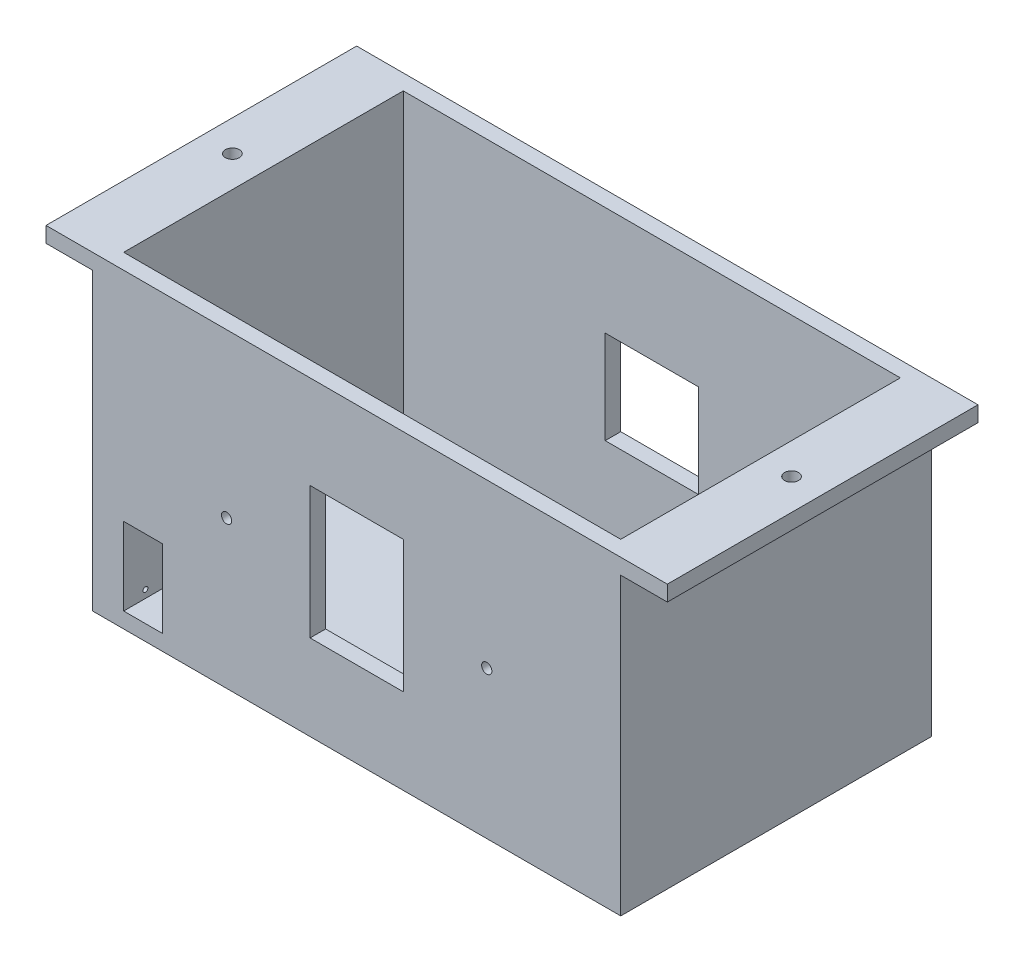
ISO-10303-21;
HEADER;
FILE_DESCRIPTION(('STEP AP214'),'2;1');
FILE_NAME('part.step','',(''),(''),'','','');
FILE_SCHEMA(('AUTOMOTIVE_DESIGN { 1 0 10303 214 1 1 1 1 }'));
ENDSEC;
DATA;
#1=APPLICATION_CONTEXT('core data for automotive mechanical design processes');
#2=APPLICATION_PROTOCOL_DEFINITION('international standard','automotive_design',2000,#1);
#3=PRODUCT_CONTEXT('',#1,'mechanical');
#4=PRODUCT('Part','Part','',(#3));
#5=PRODUCT_RELATED_PRODUCT_CATEGORY('part','',(#4));
#6=PRODUCT_DEFINITION_FORMATION('','',#4);
#7=PRODUCT_DEFINITION_CONTEXT('part definition',#1,'design');
#8=PRODUCT_DEFINITION('design','',#6,#7);
#9=PRODUCT_DEFINITION_SHAPE('','',#8);
#10=(LENGTH_UNIT() NAMED_UNIT(*) SI_UNIT(.MILLI.,.METRE.));
#11=(NAMED_UNIT(*) PLANE_ANGLE_UNIT() SI_UNIT($,.RADIAN.));
#12=(NAMED_UNIT(*) SI_UNIT($,.STERADIAN.) SOLID_ANGLE_UNIT());
#13=UNCERTAINTY_MEASURE_WITH_UNIT(LENGTH_MEASURE(1.E-05),#10,'distance_accuracy_value','');
#14=(GEOMETRIC_REPRESENTATION_CONTEXT(3) GLOBAL_UNCERTAINTY_ASSIGNED_CONTEXT((#13)) GLOBAL_UNIT_ASSIGNED_CONTEXT((#10,
#11,#12)) REPRESENTATION_CONTEXT('',''));
#15=CARTESIAN_POINT('',(0.,0.,0.));
#16=DIRECTION('',(0.,0.,1.));
#17=DIRECTION('',(1.,0.,0.));
#18=AXIS2_PLACEMENT_3D('',#15,#16,#17);
#19=CARTESIAN_POINT('',(-48.4829600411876,5.,-31.65285185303));
#20=DIRECTION('',(-1.,0.,0.));
#21=DIRECTION('',(0.,0.,1.));
#22=AXIS2_PLACEMENT_3D('',#19,#20,#21);
#23=PLANE('',#22);
#24=DIRECTION('',(0.,1.,0.));
#25=VECTOR('',#24,1.);
#26=CARTESIAN_POINT('',(-48.4829600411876,5.,13.34714814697));
#27=LINE('',#26,#25);
#28=CARTESIAN_POINT('',(-48.4829600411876,5.,13.34714814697));
#29=VERTEX_POINT('',#28);
#30=CARTESIAN_POINT('',(-48.4829600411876,30.,13.34714814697));
#31=VERTEX_POINT('',#30);
#32=EDGE_CURVE('E286',#29,#31,#27,.T.);
#33=ORIENTED_EDGE('',*,*,#32,.F.);
#34=DIRECTION('',(0.,0.,1.));
#35=VECTOR('',#34,1.);
#36=CARTESIAN_POINT('',(-48.4829600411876,5.,-31.65285185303));
#37=LINE('',#36,#35);
#38=CARTESIAN_POINT('',(-48.4829600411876,5.,-31.65285185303));
#39=VERTEX_POINT('',#38);
#40=EDGE_CURVE('E390',#39,#29,#37,.T.);
#41=ORIENTED_EDGE('',*,*,#40,.F.);
#42=DIRECTION('',(0.,1.,0.));
#43=VECTOR('',#42,1.);
#44=CARTESIAN_POINT('',(-48.4829600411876,5.,-31.65285185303));
#45=LINE('',#44,#43);
#46=CARTESIAN_POINT('',(-48.4829600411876,100.,-31.65285185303));
#47=VERTEX_POINT('',#46);
#48=EDGE_CURVE('E413',#39,#47,#45,.T.);
#49=ORIENTED_EDGE('',*,*,#48,.T.);
#50=DIRECTION('',(0.,0.,1.));
#51=VECTOR('',#50,1.);
#52=CARTESIAN_POINT('',(-48.4829600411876,100.,-31.65285185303));
#53=LINE('',#52,#51);
#54=CARTESIAN_POINT('',(-48.4829600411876,100.,58.34714814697));
#55=VERTEX_POINT('',#54);
#56=EDGE_CURVE('E372',#47,#55,#53,.T.);
#57=ORIENTED_EDGE('',*,*,#56,.T.);
#58=DIRECTION('',(0.,1.,0.));
#59=VECTOR('',#58,1.);
#60=CARTESIAN_POINT('',(-48.4829600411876,5.,58.34714814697));
#61=LINE('',#60,#59);
#62=CARTESIAN_POINT('',(-48.4829600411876,30.,58.34714814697));
#63=VERTEX_POINT('',#62);
#64=EDGE_CURVE('E402',#63,#55,#61,.T.);
#65=ORIENTED_EDGE('',*,*,#64,.F.);
#66=DIRECTION('',(0.,0.,1.));
#67=VECTOR('',#66,1.);
#68=CARTESIAN_POINT('',(-48.4829600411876,30.,13.34714814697));
#69=LINE('',#68,#67);
#70=EDGE_CURVE('E294',#31,#63,#69,.T.);
#71=ORIENTED_EDGE('',*,*,#70,.F.);
#72=EDGE_LOOP('',(#33,#41,#49,#57,#65,#71));
#73=FACE_BOUND('',#72,.T.);
#74=ADVANCED_FACE('F43',(#73),#23,.F.);
#75=CARTESIAN_POINT('',(-48.4829600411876,5.,58.34714814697));
#76=DIRECTION('',(0.,0.,1.));
#77=DIRECTION('',(1.,0.,0.));
#78=AXIS2_PLACEMENT_3D('',#75,#76,#77);
#79=PLANE('',#78);
#80=CARTESIAN_POINT('',(73.3920399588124,47.5,58.34714814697));
#81=DIRECTION('',(0.,0.,1.));
#82=DIRECTION('',(1.,0.,0.));
#83=AXIS2_PLACEMENT_3D('',#80,#81,#82);
#84=CIRCLE('',#83,1.65);
#85=CARTESIAN_POINT('',(75.0420399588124,47.5,58.34714814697));
#86=VERTEX_POINT('',#85);
#87=EDGE_CURVE('E342',#86,#86,#84,.T.);
#88=ORIENTED_EDGE('',*,*,#87,.T.);
#89=EDGE_LOOP('',(#88));
#90=FACE_BOUND('',#89,.T.);
#91=CARTESIAN_POINT('',(-10.3579600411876,47.5,58.34714814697));
#92=DIRECTION('',(0.,0.,1.));
#93=DIRECTION('',(1.,0.,0.));
#94=AXIS2_PLACEMENT_3D('',#91,#92,#93);
#95=CIRCLE('',#94,1.65);
#96=CARTESIAN_POINT('',(-8.70796004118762,47.5,58.34714814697));
#97=VERTEX_POINT('',#96);
#98=EDGE_CURVE('E336',#97,#97,#95,.T.);
#99=ORIENTED_EDGE('',*,*,#98,.T.);
#100=EDGE_LOOP('',(#99));
#101=FACE_BOUND('',#100,.T.);
#102=DIRECTION('',(-1.,0.,0.));
#103=VECTOR('',#102,1.);
#104=CARTESIAN_POINT('',(-48.4829600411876,70.,58.34714814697));
#105=LINE('',#104,#103);
#106=CARTESIAN_POINT('',(46.5170399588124,70.,58.34714814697));
#107=VERTEX_POINT('',#106);
#108=CARTESIAN_POINT('',(16.5170399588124,70.,58.34714814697));
#109=VERTEX_POINT('',#108);
#110=EDGE_CURVE('E457',#107,#109,#105,.T.);
#111=ORIENTED_EDGE('',*,*,#110,.T.);
#112=DIRECTION('',(0.,-1.,0.));
#113=VECTOR('',#112,1.);
#114=CARTESIAN_POINT('',(16.5170399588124,5.00000000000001,58.34714814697));
#115=LINE('',#114,#113);
#116=CARTESIAN_POINT('',(16.5170399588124,27.5,58.34714814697));
#117=VERTEX_POINT('',#116);
#118=EDGE_CURVE('E455',#109,#117,#115,.T.);
#119=ORIENTED_EDGE('',*,*,#118,.T.);
#120=DIRECTION('',(1.,0.,0.));
#121=VECTOR('',#120,1.);
#122=CARTESIAN_POINT('',(-48.4829600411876,27.5,58.34714814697));
#123=LINE('',#122,#121);
#124=CARTESIAN_POINT('',(46.5170399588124,27.5,58.34714814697));
#125=VERTEX_POINT('',#124);
#126=EDGE_CURVE('E448',#117,#125,#123,.T.);
#127=ORIENTED_EDGE('',*,*,#126,.T.);
#128=DIRECTION('',(0.,1.,0.));
#129=VECTOR('',#128,1.);
#130=CARTESIAN_POINT('',(46.5170399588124,5.00000000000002,58.34714814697));
#131=LINE('',#130,#129);
#132=EDGE_CURVE('E453',#125,#107,#131,.T.);
#133=ORIENTED_EDGE('',*,*,#132,.T.);
#134=EDGE_LOOP('',(#111,#119,#127,#133));
#135=FACE_BOUND('',#134,.T.);
#136=DIRECTION('',(0.,1.,0.));
#137=VECTOR('',#136,1.);
#138=CARTESIAN_POINT('',(-30.9829600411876,30.,58.34714814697));
#139=LINE('',#138,#137);
#140=CARTESIAN_POINT('',(-30.9829600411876,5.,58.34714814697));
#141=VERTEX_POINT('',#140);
#142=CARTESIAN_POINT('',(-30.9829600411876,30.,58.34714814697));
#143=VERTEX_POINT('',#142);
#144=EDGE_CURVE('E266',#141,#143,#139,.T.);
#145=ORIENTED_EDGE('',*,*,#144,.T.);
#146=DIRECTION('',(-1.,0.,0.));
#147=VECTOR('',#146,1.);
#148=CARTESIAN_POINT('',(-43.4829600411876,30.,58.34714814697));
#149=LINE('',#148,#147);
#150=CARTESIAN_POINT('',(-43.4829600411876,30.,58.34714814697));
#151=VERTEX_POINT('',#150);
#152=EDGE_CURVE('E269',#143,#151,#149,.T.);
#153=ORIENTED_EDGE('',*,*,#152,.T.);
#154=DIRECTION('',(-1.,0.,0.));
#155=VECTOR('',#154,1.);
#156=CARTESIAN_POINT('',(-43.4829600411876,30.,58.34714814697));
#157=LINE('',#156,#155);
#158=EDGE_CURVE('E307',#151,#63,#157,.T.);
#159=ORIENTED_EDGE('',*,*,#158,.T.);
#160=ORIENTED_EDGE('',*,*,#64,.T.);
#161=DIRECTION('',(1.,0.,0.));
#162=VECTOR('',#161,1.);
#163=CARTESIAN_POINT('',(-48.4829600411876,100.,58.34714814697));
#164=LINE('',#163,#162);
#165=CARTESIAN_POINT('',(111.517039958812,100.,58.34714814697));
#166=VERTEX_POINT('',#165);
#167=EDGE_CURVE('E405',#55,#166,#164,.T.);
#168=ORIENTED_EDGE('',*,*,#167,.T.);
#169=DIRECTION('',(0.,1.,0.));
#170=VECTOR('',#169,1.);
#171=CARTESIAN_POINT('',(111.517039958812,5.,58.34714814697));
#172=LINE('',#171,#170);
#173=CARTESIAN_POINT('',(111.517039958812,5.,58.34714814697));
#174=VERTEX_POINT('',#173);
#175=EDGE_CURVE('E418',#174,#166,#172,.T.);
#176=ORIENTED_EDGE('',*,*,#175,.F.);
#177=DIRECTION('',(1.,0.,0.));
#178=VECTOR('',#177,1.);
#179=CARTESIAN_POINT('',(-48.4829600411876,5.,58.34714814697));
#180=LINE('',#179,#178);
#181=EDGE_CURVE('E393',#141,#174,#180,.T.);
#182=ORIENTED_EDGE('',*,*,#181,.F.);
#183=EDGE_LOOP('',(#145,#153,#159,#160,#168,#176,#182));
#184=FACE_BOUND('',#183,.T.);
#185=ADVANCED_FACE('F483',(#90,#101,#135,#184),#79,.F.);
#186=CARTESIAN_POINT('',(0.,5.,0.));
#187=DIRECTION('',(0.,1.,0.));
#188=DIRECTION('',(0.,0.,1.));
#189=AXIS2_PLACEMENT_3D('',#186,#187,#188);
#190=PLANE('',#189);
#191=ORIENTED_EDGE('',*,*,#40,.T.);
#192=DIRECTION('',(-1.,0.,0.));
#193=VECTOR('',#192,1.);
#194=CARTESIAN_POINT('',(-43.4829600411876,5.,13.34714814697));
#195=LINE('',#194,#193);
#196=CARTESIAN_POINT('',(-43.4829600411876,5.,13.34714814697));
#197=VERTEX_POINT('',#196);
#198=EDGE_CURVE('E300',#197,#29,#195,.T.);
#199=ORIENTED_EDGE('',*,*,#198,.F.);
#200=DIRECTION('',(0.,0.,-1.));
#201=VECTOR('',#200,1.);
#202=CARTESIAN_POINT('',(-43.4829600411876,5.,13.34714814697));
#203=LINE('',#202,#201);
#204=CARTESIAN_POINT('',(-43.4829600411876,5.,63.34714814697));
#205=VERTEX_POINT('',#204);
#206=EDGE_CURVE('E297',#205,#197,#203,.T.);
#207=ORIENTED_EDGE('',*,*,#206,.F.);
#208=DIRECTION('',(1.,0.,0.));
#209=VECTOR('',#208,1.);
#210=CARTESIAN_POINT('',(-43.4829600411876,5.,63.34714814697));
#211=LINE('',#210,#209);
#212=CARTESIAN_POINT('',(-30.9829600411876,5.,63.34714814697));
#213=VERTEX_POINT('',#212);
#214=EDGE_CURVE('E276',#205,#213,#211,.T.);
#215=ORIENTED_EDGE('',*,*,#214,.T.);
#216=DIRECTION('',(0.,0.,1.));
#217=VECTOR('',#216,1.);
#218=CARTESIAN_POINT('',(-30.9829600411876,5.,58.34714814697));
#219=LINE('',#218,#217);
#220=EDGE_CURVE('E273',#141,#213,#219,.T.);
#221=ORIENTED_EDGE('',*,*,#220,.F.);
#222=ORIENTED_EDGE('',*,*,#181,.T.);
#223=DIRECTION('',(0.,0.,-1.));
#224=VECTOR('',#223,1.);
#225=CARTESIAN_POINT('',(111.517039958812,5.,-31.65285185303));
#226=LINE('',#225,#224);
#227=CARTESIAN_POINT('',(111.517039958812,5.,-31.65285185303));
#228=VERTEX_POINT('',#227);
#229=EDGE_CURVE('E396',#174,#228,#226,.T.);
#230=ORIENTED_EDGE('',*,*,#229,.T.);
#231=DIRECTION('',(-1.,0.,0.));
#232=VECTOR('',#231,1.);
#233=CARTESIAN_POINT('',(-48.4829600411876,5.,-31.65285185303));
#234=LINE('',#233,#232);
#235=EDGE_CURVE('E399',#228,#39,#234,.T.);
#236=ORIENTED_EDGE('',*,*,#235,.T.);
#237=EDGE_LOOP('',(#191,#199,#207,#215,#221,#222,#230,#236));
#238=FACE_BOUND('',#237,.T.);
#239=ADVANCED_FACE('F489',(#238),#190,.T.);
#240=CARTESIAN_POINT('',(-68.4829600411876,100.,-36.65285185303));
#241=DIRECTION('',(1.,0.,0.));
#242=DIRECTION('',(0.,0.,-1.));
#243=AXIS2_PLACEMENT_3D('',#240,#241,#242);
#244=PLANE('',#243);
#245=DIRECTION('',(0.,0.,-1.));
#246=VECTOR('',#245,1.);
#247=CARTESIAN_POINT('',(-68.4829600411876,95.,63.34714814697));
#248=LINE('',#247,#246);
#249=CARTESIAN_POINT('',(-68.4829600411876,95.,63.34714814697));
#250=VERTEX_POINT('',#249);
#251=CARTESIAN_POINT('',(-68.4829600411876,95.,-36.65285185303));
#252=VERTEX_POINT('',#251);
#253=EDGE_CURVE('E355',#250,#252,#248,.T.);
#254=ORIENTED_EDGE('',*,*,#253,.F.);
#255=DIRECTION('',(0.,-1.,0.));
#256=VECTOR('',#255,1.);
#257=CARTESIAN_POINT('',(-68.4829600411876,100.,63.34714814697));
#258=LINE('',#257,#256);
#259=CARTESIAN_POINT('',(-68.4829600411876,100.,63.34714814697));
#260=VERTEX_POINT('',#259);
#261=EDGE_CURVE('E432',#260,#250,#258,.T.);
#262=ORIENTED_EDGE('',*,*,#261,.F.);
#263=DIRECTION('',(0.,0.,1.));
#264=VECTOR('',#263,1.);
#265=CARTESIAN_POINT('',(-68.4829600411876,100.,-36.65285185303));
#266=LINE('',#265,#264);
#267=CARTESIAN_POINT('',(-68.4829600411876,100.,-36.65285185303));
#268=VERTEX_POINT('',#267);
#269=EDGE_CURVE('E430',#268,#260,#266,.T.);
#270=ORIENTED_EDGE('',*,*,#269,.F.);
#271=DIRECTION('',(0.,-1.,0.));
#272=VECTOR('',#271,1.);
#273=CARTESIAN_POINT('',(-68.4829600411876,100.,-36.65285185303));
#274=LINE('',#273,#272);
#275=EDGE_CURVE('E439',#268,#252,#274,.T.);
#276=ORIENTED_EDGE('',*,*,#275,.T.);
#277=EDGE_LOOP('',(#254,#262,#270,#276));
#278=FACE_BOUND('',#277,.T.);
#279=ADVANCED_FACE('F502',(#278),#244,.F.);
#280=CARTESIAN_POINT('',(-68.4829600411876,100.,63.34714814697));
#281=DIRECTION('',(0.,0.,-1.));
#282=DIRECTION('',(-1.,0.,0.));
#283=AXIS2_PLACEMENT_3D('',#280,#281,#282);
#284=PLANE('',#283);
#285=ORIENTED_EDGE('',*,*,#214,.F.);
#286=DIRECTION('',(0.,-1.,0.));
#287=VECTOR('',#286,1.);
#288=CARTESIAN_POINT('',(-43.4829600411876,30.,63.34714814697));
#289=LINE('',#288,#287);
#290=CARTESIAN_POINT('',(-43.4829600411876,30.,63.34714814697));
#291=VERTEX_POINT('',#290);
#292=EDGE_CURVE('E265',#291,#205,#289,.T.);
#293=ORIENTED_EDGE('',*,*,#292,.F.);
#294=DIRECTION('',(-1.,0.,0.));
#295=VECTOR('',#294,1.);
#296=CARTESIAN_POINT('',(-43.4829600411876,30.,63.34714814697));
#297=LINE('',#296,#295);
#298=CARTESIAN_POINT('',(-30.9829600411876,30.,63.34714814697));
#299=VERTEX_POINT('',#298);
#300=EDGE_CURVE('E270',#299,#291,#297,.T.);
#301=ORIENTED_EDGE('',*,*,#300,.F.);
#302=DIRECTION('',(0.,1.,0.));
#303=VECTOR('',#302,1.);
#304=CARTESIAN_POINT('',(-30.9829600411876,30.,63.34714814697));
#305=LINE('',#304,#303);
#306=EDGE_CURVE('E279',#213,#299,#305,.T.);
#307=ORIENTED_EDGE('',*,*,#306,.F.);
#308=EDGE_LOOP('',(#285,#293,#301,#307));
#309=FACE_BOUND('',#308,.T.);
#310=DIRECTION('',(0.,-1.,0.));
#311=VECTOR('',#310,1.);
#312=CARTESIAN_POINT('',(16.5170399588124,67.5,63.34714814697));
#313=LINE('',#312,#311);
#314=CARTESIAN_POINT('',(16.5170399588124,70.,63.34714814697));
#315=VERTEX_POINT('',#314);
#316=CARTESIAN_POINT('',(16.5170399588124,27.5,63.34714814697));
#317=VERTEX_POINT('',#316);
#318=EDGE_CURVE('E319',#315,#317,#313,.T.);
#319=ORIENTED_EDGE('',*,*,#318,.F.);
#320=DIRECTION('',(-1.,0.,0.));
#321=VECTOR('',#320,1.);
#322=CARTESIAN_POINT('',(16.5170399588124,70.,63.34714814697));
#323=LINE('',#322,#321);
#324=CARTESIAN_POINT('',(46.5170399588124,70.,63.34714814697));
#325=VERTEX_POINT('',#324);
#326=EDGE_CURVE('E312',#325,#315,#323,.T.);
#327=ORIENTED_EDGE('',*,*,#326,.F.);
#328=DIRECTION('',(0.,1.,0.));
#329=VECTOR('',#328,1.);
#330=CARTESIAN_POINT('',(46.5170399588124,67.5,63.34714814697));
#331=LINE('',#330,#329);
#332=CARTESIAN_POINT('',(46.5170399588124,27.5,63.34714814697));
#333=VERTEX_POINT('',#332);
#334=EDGE_CURVE('E326',#333,#325,#331,.T.);
#335=ORIENTED_EDGE('',*,*,#334,.F.);
#336=DIRECTION('',(1.,0.,0.));
#337=VECTOR('',#336,1.);
#338=CARTESIAN_POINT('',(16.5170399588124,27.5,63.34714814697));
#339=LINE('',#338,#337);
#340=EDGE_CURVE('E323',#317,#333,#339,.T.);
#341=ORIENTED_EDGE('',*,*,#340,.F.);
#342=EDGE_LOOP('',(#319,#327,#335,#341));
#343=FACE_BOUND('',#342,.T.);
#344=CARTESIAN_POINT('',(-10.3579600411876,47.5,63.34714814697));
#345=DIRECTION('',(0.,0.,1.));
#346=DIRECTION('',(1.,0.,0.));
#347=AXIS2_PLACEMENT_3D('',#344,#345,#346);
#348=CIRCLE('',#347,1.65);
#349=CARTESIAN_POINT('',(-8.70796004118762,47.5,63.34714814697));
#350=VERTEX_POINT('',#349);
#351=EDGE_CURVE('E331',#350,#350,#348,.T.);
#352=ORIENTED_EDGE('',*,*,#351,.F.);
#353=EDGE_LOOP('',(#352));
#354=FACE_BOUND('',#353,.T.);
#355=CARTESIAN_POINT('',(73.3920399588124,47.5,63.34714814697));
#356=DIRECTION('',(0.,0.,1.));
#357=DIRECTION('',(1.,0.,0.));
#358=AXIS2_PLACEMENT_3D('',#355,#356,#357);
#359=CIRCLE('',#358,1.65);
#360=CARTESIAN_POINT('',(75.0420399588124,47.5,63.34714814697));
#361=VERTEX_POINT('',#360);
#362=EDGE_CURVE('E339',#361,#361,#359,.T.);
#363=ORIENTED_EDGE('',*,*,#362,.F.);
#364=EDGE_LOOP('',(#363));
#365=FACE_BOUND('',#364,.T.);
#366=DIRECTION('',(-1.,0.,0.));
#367=VECTOR('',#366,1.);
#368=CARTESIAN_POINT('',(-68.4829600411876,95.,63.34714814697));
#369=LINE('',#368,#367);
#370=CARTESIAN_POINT('',(-53.4829600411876,95.,63.34714814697));
#371=VERTEX_POINT('',#370);
#372=EDGE_CURVE('E364',#371,#250,#369,.T.);
#373=ORIENTED_EDGE('',*,*,#372,.F.);
#374=DIRECTION('',(0.,-1.,0.));
#375=VECTOR('',#374,1.);
#376=CARTESIAN_POINT('',(-53.4829600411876,95.,63.34714814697));
#377=LINE('',#376,#375);
#378=CARTESIAN_POINT('',(-53.4829600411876,0.,63.34714814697));
#379=VERTEX_POINT('',#378);
#380=EDGE_CURVE('E369',#371,#379,#377,.T.);
#381=ORIENTED_EDGE('',*,*,#380,.T.);
#382=DIRECTION('',(1.,0.,0.));
#383=VECTOR('',#382,1.);
#384=CARTESIAN_POINT('',(-68.4829600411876,0.,63.34714814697));
#385=LINE('',#384,#383);
#386=CARTESIAN_POINT('',(116.517039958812,0.,63.34714814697));
#387=VERTEX_POINT('',#386);
#388=EDGE_CURVE('E415',#379,#387,#385,.T.);
#389=ORIENTED_EDGE('',*,*,#388,.T.);
#390=DIRECTION('',(0.,-1.,0.));
#391=VECTOR('',#390,1.);
#392=CARTESIAN_POINT('',(116.517039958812,95.,63.34714814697));
#393=LINE('',#392,#391);
#394=CARTESIAN_POINT('',(116.517039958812,95.,63.34714814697));
#395=VERTEX_POINT('',#394);
#396=EDGE_CURVE('E385',#395,#387,#393,.T.);
#397=ORIENTED_EDGE('',*,*,#396,.F.);
#398=DIRECTION('',(-1.,0.,0.));
#399=VECTOR('',#398,1.);
#400=CARTESIAN_POINT('',(131.517039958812,95.,63.34714814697));
#401=LINE('',#400,#399);
#402=CARTESIAN_POINT('',(131.517039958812,95.,63.34714814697));
#403=VERTEX_POINT('',#402);
#404=EDGE_CURVE('E376',#403,#395,#401,.T.);
#405=ORIENTED_EDGE('',*,*,#404,.F.);
#406=DIRECTION('',(0.,-1.,0.));
#407=VECTOR('',#406,1.);
#408=CARTESIAN_POINT('',(131.517039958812,100.,63.34714814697));
#409=LINE('',#408,#407);
#410=CARTESIAN_POINT('',(131.517039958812,100.,63.34714814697));
#411=VERTEX_POINT('',#410);
#412=EDGE_CURVE('E445',#411,#403,#409,.T.);
#413=ORIENTED_EDGE('',*,*,#412,.F.);
#414=DIRECTION('',(1.,0.,0.));
#415=VECTOR('',#414,1.);
#416=CARTESIAN_POINT('',(-68.4829600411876,100.,63.34714814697));
#417=LINE('',#416,#415);
#418=EDGE_CURVE('E421',#260,#411,#417,.T.);
#419=ORIENTED_EDGE('',*,*,#418,.F.);
#420=ORIENTED_EDGE('',*,*,#261,.T.);
#421=EDGE_LOOP('',(#373,#381,#389,#397,#405,#413,#419,#420));
#422=FACE_BOUND('',#421,.T.);
#423=ADVANCED_FACE('F45',(#309,#343,#354,#365,#422),#284,.F.);
#424=CARTESIAN_POINT('',(131.517039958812,100.,-36.65285185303));
#425=DIRECTION('',(1.,0.,0.));
#426=DIRECTION('',(0.,0.,-1.));
#427=AXIS2_PLACEMENT_3D('',#424,#425,#426);
#428=PLANE('',#427);
#429=DIRECTION('',(0.,0.,1.));
#430=VECTOR('',#429,1.);
#431=CARTESIAN_POINT('',(131.517039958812,95.,63.34714814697));
#432=LINE('',#431,#430);
#433=CARTESIAN_POINT('',(131.517039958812,95.,-36.65285185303));
#434=VERTEX_POINT('',#433);
#435=EDGE_CURVE('E374',#434,#403,#432,.T.);
#436=ORIENTED_EDGE('',*,*,#435,.F.);
#437=DIRECTION('',(0.,-1.,0.));
#438=VECTOR('',#437,1.);
#439=CARTESIAN_POINT('',(131.517039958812,100.,-36.65285185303));
#440=LINE('',#439,#438);
#441=CARTESIAN_POINT('',(131.517039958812,100.,-36.65285185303));
#442=VERTEX_POINT('',#441);
#443=EDGE_CURVE('E442',#442,#434,#440,.T.);
#444=ORIENTED_EDGE('',*,*,#443,.F.);
#445=DIRECTION('',(0.,0.,1.));
#446=VECTOR('',#445,1.);
#447=CARTESIAN_POINT('',(131.517039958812,100.,-36.65285185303));
#448=LINE('',#447,#446);
#449=EDGE_CURVE('E423',#442,#411,#448,.T.);
#450=ORIENTED_EDGE('',*,*,#449,.T.);
#451=ORIENTED_EDGE('',*,*,#412,.T.);
#452=EDGE_LOOP('',(#436,#444,#450,#451));
#453=FACE_BOUND('',#452,.T.);
#454=ADVANCED_FACE('F507',(#453),#428,.T.);
#455=CARTESIAN_POINT('',(-68.4829600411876,100.,-36.65285185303));
#456=DIRECTION('',(0.,0.,-1.));
#457=DIRECTION('',(-1.,0.,0.));
#458=AXIS2_PLACEMENT_3D('',#455,#456,#457);
#459=PLANE('',#458);
#460=DIRECTION('',(0.,-1.,0.));
#461=VECTOR('',#460,1.);
#462=CARTESIAN_POINT('',(46.5170399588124,65.,-36.65285185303));
#463=LINE('',#462,#461);
#464=CARTESIAN_POINT('',(46.5170399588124,65.,-36.65285185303));
#465=VERTEX_POINT('',#464);
#466=CARTESIAN_POINT('',(46.5170399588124,35.,-36.65285185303));
#467=VERTEX_POINT('',#466);
#468=EDGE_CURVE('E58',#465,#467,#463,.T.);
#469=ORIENTED_EDGE('',*,*,#468,.F.);
#470=DIRECTION('',(1.,0.,0.));
#471=VECTOR('',#470,1.);
#472=CARTESIAN_POINT('',(46.5170399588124,65.,-36.65285185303));
#473=LINE('',#472,#471);
#474=CARTESIAN_POINT('',(16.5170399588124,65.,-36.65285185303));
#475=VERTEX_POINT('',#474);
#476=EDGE_CURVE('E232',#475,#465,#473,.T.);
#477=ORIENTED_EDGE('',*,*,#476,.F.);
#478=DIRECTION('',(0.,1.,0.));
#479=VECTOR('',#478,1.);
#480=CARTESIAN_POINT('',(16.5170399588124,65.,-36.65285185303));
#481=LINE('',#480,#479);
#482=CARTESIAN_POINT('',(16.5170399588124,35.,-36.65285185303));
#483=VERTEX_POINT('',#482);
#484=EDGE_CURVE('E216',#483,#475,#481,.T.);
#485=ORIENTED_EDGE('',*,*,#484,.F.);
#486=DIRECTION('',(-1.,0.,0.));
#487=VECTOR('',#486,1.);
#488=CARTESIAN_POINT('',(46.5170399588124,35.,-36.65285185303));
#489=LINE('',#488,#487);
#490=EDGE_CURVE('E225',#467,#483,#489,.T.);
#491=ORIENTED_EDGE('',*,*,#490,.F.);
#492=EDGE_LOOP('',(#469,#477,#485,#491));
#493=FACE_BOUND('',#492,.T.);
#494=DIRECTION('',(0.,-1.,0.));
#495=VECTOR('',#494,1.);
#496=CARTESIAN_POINT('',(-53.4829600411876,95.,-36.65285185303));
#497=LINE('',#496,#495);
#498=CARTESIAN_POINT('',(-53.4829600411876,95.,-36.65285185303));
#499=VERTEX_POINT('',#498);
#500=CARTESIAN_POINT('',(-53.4829600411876,0.,-36.65285185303));
#501=VERTEX_POINT('',#500);
#502=EDGE_CURVE('E366',#499,#501,#497,.T.);
#503=ORIENTED_EDGE('',*,*,#502,.F.);
#504=DIRECTION('',(1.,0.,0.));
#505=VECTOR('',#504,1.);
#506=CARTESIAN_POINT('',(-68.4829600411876,95.,-36.65285185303));
#507=LINE('',#506,#505);
#508=EDGE_CURVE('E357',#252,#499,#507,.T.);
#509=ORIENTED_EDGE('',*,*,#508,.F.);
#510=ORIENTED_EDGE('',*,*,#275,.F.);
#511=DIRECTION('',(1.,0.,0.));
#512=VECTOR('',#511,1.);
#513=CARTESIAN_POINT('',(-68.4829600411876,100.,-36.65285185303));
#514=LINE('',#513,#512);
#515=EDGE_CURVE('E427',#268,#442,#514,.T.);
#516=ORIENTED_EDGE('',*,*,#515,.T.);
#517=ORIENTED_EDGE('',*,*,#443,.T.);
#518=DIRECTION('',(1.,0.,0.));
#519=VECTOR('',#518,1.);
#520=CARTESIAN_POINT('',(131.517039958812,95.,-36.65285185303));
#521=LINE('',#520,#519);
#522=CARTESIAN_POINT('',(116.517039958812,95.,-36.65285185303));
#523=VERTEX_POINT('',#522);
#524=EDGE_CURVE('E383',#523,#434,#521,.T.);
#525=ORIENTED_EDGE('',*,*,#524,.F.);
#526=DIRECTION('',(0.,-1.,0.));
#527=VECTOR('',#526,1.);
#528=CARTESIAN_POINT('',(116.517039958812,95.,-36.65285185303));
#529=LINE('',#528,#527);
#530=CARTESIAN_POINT('',(116.517039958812,0.,-36.65285185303));
#531=VERTEX_POINT('',#530);
#532=EDGE_CURVE('E368',#523,#531,#529,.T.);
#533=ORIENTED_EDGE('',*,*,#532,.T.);
#534=DIRECTION('',(1.,0.,0.));
#535=VECTOR('',#534,1.);
#536=CARTESIAN_POINT('',(-68.4829600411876,0.,-36.65285185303));
#537=LINE('',#536,#535);
#538=EDGE_CURVE('E424',#501,#531,#537,.T.);
#539=ORIENTED_EDGE('',*,*,#538,.F.);
#540=EDGE_LOOP('',(#503,#509,#510,#516,#517,#525,#533,#539));
#541=FACE_BOUND('',#540,.T.);
#542=ADVANCED_FACE('F229',(#493,#541),#459,.T.);
#543=CARTESIAN_POINT('',(0.,100.,0.));
#544=DIRECTION('',(0.,-1.,0.));
#545=DIRECTION('',(0.,0.,-1.));
#546=AXIS2_PLACEMENT_3D('',#543,#544,#545);
#547=PLANE('',#546);
#548=CARTESIAN_POINT('',(-58.4829600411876,100.,13.34714814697));
#549=DIRECTION('',(0.,1.,0.));
#550=DIRECTION('',(0.,0.,1.));
#551=AXIS2_PLACEMENT_3D('',#548,#549,#550);
#552=CIRCLE('',#551,2.24789999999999);
#553=CARTESIAN_POINT('',(-58.4829600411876,100.,15.59504814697));
#554=VERTEX_POINT('',#553);
#555=EDGE_CURVE('E345',#554,#554,#552,.T.);
#556=ORIENTED_EDGE('',*,*,#555,.F.);
#557=EDGE_LOOP('',(#556));
#558=FACE_BOUND('',#557,.T.);
#559=CARTESIAN_POINT('',(121.517039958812,100.,13.34714814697));
#560=DIRECTION('',(0.,1.,0.));
#561=DIRECTION('',(0.,0.,1.));
#562=AXIS2_PLACEMENT_3D('',#559,#560,#561);
#563=CIRCLE('',#562,2.24789999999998);
#564=CARTESIAN_POINT('',(121.517039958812,100.,15.59504814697));
#565=VERTEX_POINT('',#564);
#566=EDGE_CURVE('E351',#565,#565,#563,.T.);
#567=ORIENTED_EDGE('',*,*,#566,.F.);
#568=EDGE_LOOP('',(#567));
#569=FACE_BOUND('',#568,.T.);
#570=ORIENTED_EDGE('',*,*,#167,.F.);
#571=ORIENTED_EDGE('',*,*,#56,.F.);
#572=DIRECTION('',(-1.,0.,0.));
#573=VECTOR('',#572,1.);
#574=CARTESIAN_POINT('',(-48.4829600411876,100.,-31.65285185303));
#575=LINE('',#574,#573);
#576=CARTESIAN_POINT('',(111.517039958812,100.,-31.65285185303));
#577=VERTEX_POINT('',#576);
#578=EDGE_CURVE('E394',#577,#47,#575,.T.);
#579=ORIENTED_EDGE('',*,*,#578,.F.);
#580=DIRECTION('',(0.,0.,-1.));
#581=VECTOR('',#580,1.);
#582=CARTESIAN_POINT('',(111.517039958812,100.,-31.65285185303));
#583=LINE('',#582,#581);
#584=EDGE_CURVE('E408',#166,#577,#583,.T.);
#585=ORIENTED_EDGE('',*,*,#584,.F.);
#586=EDGE_LOOP('',(#570,#571,#579,#585));
#587=FACE_BOUND('',#586,.T.);
#588=ORIENTED_EDGE('',*,*,#418,.T.);
#589=ORIENTED_EDGE('',*,*,#449,.F.);
#590=ORIENTED_EDGE('',*,*,#515,.F.);
#591=ORIENTED_EDGE('',*,*,#269,.T.);
#592=EDGE_LOOP('',(#588,#589,#590,#591));
#593=FACE_BOUND('',#592,.T.);
#594=ADVANCED_FACE('F494',(#558,#569,#587,#593),#547,.F.);
#595=CARTESIAN_POINT('',(0.,0.,0.));
#596=DIRECTION('',(0.,-1.,0.));
#597=DIRECTION('',(0.,0.,-1.));
#598=AXIS2_PLACEMENT_3D('',#595,#596,#597);
#599=PLANE('',#598);
#600=DIRECTION('',(0.,0.,1.));
#601=VECTOR('',#600,1.);
#602=CARTESIAN_POINT('',(-53.4829600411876,0.,63.34714814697));
#603=LINE('',#602,#601);
#604=EDGE_CURVE('E358',#501,#379,#603,.T.);
#605=ORIENTED_EDGE('',*,*,#604,.F.);
#606=ORIENTED_EDGE('',*,*,#538,.T.);
#607=DIRECTION('',(0.,0.,-1.));
#608=VECTOR('',#607,1.);
#609=CARTESIAN_POINT('',(116.517039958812,0.,63.34714814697));
#610=LINE('',#609,#608);
#611=EDGE_CURVE('E377',#387,#531,#610,.T.);
#612=ORIENTED_EDGE('',*,*,#611,.F.);
#613=ORIENTED_EDGE('',*,*,#388,.F.);
#614=EDGE_LOOP('',(#605,#606,#612,#613));
#615=FACE_BOUND('',#614,.T.);
#616=ADVANCED_FACE('F497',(#615),#599,.T.);
#617=CARTESIAN_POINT('',(-48.4829600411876,5.,-31.65285185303));
#618=DIRECTION('',(0.,0.,-1.));
#619=DIRECTION('',(-1.,0.,0.));
#620=AXIS2_PLACEMENT_3D('',#617,#618,#619);
#621=PLANE('',#620);
#622=DIRECTION('',(1.,0.,0.));
#623=VECTOR('',#622,1.);
#624=CARTESIAN_POINT('',(-48.4829600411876,65.,-31.65285185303));
#625=LINE('',#624,#623);
#626=CARTESIAN_POINT('',(16.5170399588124,65.,-31.65285185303));
#627=VERTEX_POINT('',#626);
#628=CARTESIAN_POINT('',(46.5170399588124,65.,-31.65285185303));
#629=VERTEX_POINT('',#628);
#630=EDGE_CURVE('E51',#627,#629,#625,.T.);
#631=ORIENTED_EDGE('',*,*,#630,.T.);
#632=DIRECTION('',(0.,-1.,0.));
#633=VECTOR('',#632,1.);
#634=CARTESIAN_POINT('',(46.5170399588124,4.99999999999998,-31.65285185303));
#635=LINE('',#634,#633);
#636=CARTESIAN_POINT('',(46.5170399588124,35.,-31.65285185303));
#637=VERTEX_POINT('',#636);
#638=EDGE_CURVE('E11',#629,#637,#635,.T.);
#639=ORIENTED_EDGE('',*,*,#638,.T.);
#640=DIRECTION('',(-1.,0.,0.));
#641=VECTOR('',#640,1.);
#642=CARTESIAN_POINT('',(-48.4829600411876,35.,-31.65285185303));
#643=LINE('',#642,#641);
#644=CARTESIAN_POINT('',(16.5170399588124,35.,-31.65285185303));
#645=VERTEX_POINT('',#644);
#646=EDGE_CURVE('E460',#637,#645,#643,.T.);
#647=ORIENTED_EDGE('',*,*,#646,.T.);
#648=DIRECTION('',(0.,1.,0.));
#649=VECTOR('',#648,1.);
#650=CARTESIAN_POINT('',(16.5170399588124,5.,-31.65285185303));
#651=LINE('',#650,#649);
#652=EDGE_CURVE('E219',#645,#627,#651,.T.);
#653=ORIENTED_EDGE('',*,*,#652,.T.);
#654=EDGE_LOOP('',(#631,#639,#647,#653));
#655=FACE_BOUND('',#654,.T.);
#656=ORIENTED_EDGE('',*,*,#578,.T.);
#657=ORIENTED_EDGE('',*,*,#48,.F.);
#658=ORIENTED_EDGE('',*,*,#235,.F.);
#659=DIRECTION('',(0.,1.,0.));
#660=VECTOR('',#659,1.);
#661=CARTESIAN_POINT('',(111.517039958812,5.,-31.65285185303));
#662=LINE('',#661,#660);
#663=EDGE_CURVE('E416',#228,#577,#662,.T.);
#664=ORIENTED_EDGE('',*,*,#663,.T.);
#665=EDGE_LOOP('',(#656,#657,#658,#664));
#666=FACE_BOUND('',#665,.T.);
#667=ADVANCED_FACE('F464',(#655,#666),#621,.F.);
#668=CARTESIAN_POINT('',(111.517039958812,5.,-31.65285185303));
#669=DIRECTION('',(1.,0.,0.));
#670=DIRECTION('',(0.,0.,-1.));
#671=AXIS2_PLACEMENT_3D('',#668,#669,#670);
#672=PLANE('',#671);
#673=ORIENTED_EDGE('',*,*,#584,.T.);
#674=ORIENTED_EDGE('',*,*,#663,.F.);
#675=ORIENTED_EDGE('',*,*,#229,.F.);
#676=ORIENTED_EDGE('',*,*,#175,.T.);
#677=EDGE_LOOP('',(#673,#674,#675,#676));
#678=FACE_BOUND('',#677,.T.);
#679=ADVANCED_FACE('F564',(#678),#672,.F.);
#680=CARTESIAN_POINT('',(116.517039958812,95.,63.34714814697));
#681=DIRECTION('',(-1.,0.,0.));
#682=DIRECTION('',(0.,0.,1.));
#683=AXIS2_PLACEMENT_3D('',#680,#681,#682);
#684=PLANE('',#683);
#685=ORIENTED_EDGE('',*,*,#611,.T.);
#686=ORIENTED_EDGE('',*,*,#532,.F.);
#687=DIRECTION('',(0.,0.,-1.));
#688=VECTOR('',#687,1.);
#689=CARTESIAN_POINT('',(116.517039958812,95.,63.34714814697));
#690=LINE('',#689,#688);
#691=EDGE_CURVE('E380',#395,#523,#690,.T.);
#692=ORIENTED_EDGE('',*,*,#691,.F.);
#693=ORIENTED_EDGE('',*,*,#396,.T.);
#694=EDGE_LOOP('',(#685,#686,#692,#693));
#695=FACE_BOUND('',#694,.T.);
#696=ADVANCED_FACE('F533',(#695),#684,.F.);
#697=CARTESIAN_POINT('',(0.,95.,0.));
#698=DIRECTION('',(0.,1.,0.));
#699=DIRECTION('',(0.,0.,1.));
#700=AXIS2_PLACEMENT_3D('',#697,#698,#699);
#701=PLANE('',#700);
#702=CARTESIAN_POINT('',(121.517039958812,95.,13.34714814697));
#703=DIRECTION('',(0.,1.,0.));
#704=DIRECTION('',(0.,0.,1.));
#705=AXIS2_PLACEMENT_3D('',#702,#703,#704);
#706=CIRCLE('',#705,2.24789999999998);
#707=CARTESIAN_POINT('',(121.517039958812,95.,15.59504814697));
#708=VERTEX_POINT('',#707);
#709=EDGE_CURVE('E354',#708,#708,#706,.T.);
#710=ORIENTED_EDGE('',*,*,#709,.T.);
#711=EDGE_LOOP('',(#710));
#712=FACE_BOUND('',#711,.T.);
#713=ORIENTED_EDGE('',*,*,#435,.T.);
#714=ORIENTED_EDGE('',*,*,#404,.T.);
#715=ORIENTED_EDGE('',*,*,#691,.T.);
#716=ORIENTED_EDGE('',*,*,#524,.T.);
#717=EDGE_LOOP('',(#713,#714,#715,#716));
#718=FACE_BOUND('',#717,.T.);
#719=ADVANCED_FACE('F531',(#712,#718),#701,.F.);
#720=CARTESIAN_POINT('',(-53.4829600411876,95.,63.34714814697));
#721=DIRECTION('',(1.,0.,0.));
#722=DIRECTION('',(0.,0.,-1.));
#723=AXIS2_PLACEMENT_3D('',#720,#721,#722);
#724=PLANE('',#723);
#725=CARTESIAN_POINT('',(-53.4829600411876,27.,56.34714814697));
#726=DIRECTION('',(1.,0.,0.));
#727=DIRECTION('',(0.,0.,-1.));
#728=AXIS2_PLACEMENT_3D('',#725,#726,#727);
#729=CIRCLE('',#728,0.799999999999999);
#730=CARTESIAN_POINT('',(-53.4829600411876,27.,55.54714814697));
#731=VERTEX_POINT('',#730);
#732=EDGE_CURVE('E244',#731,#731,#729,.T.);
#733=ORIENTED_EDGE('',*,*,#732,.T.);
#734=EDGE_LOOP('',(#733));
#735=FACE_BOUND('',#734,.T.);
#736=CARTESIAN_POINT('',(-53.4829600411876,27.,18.34714814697));
#737=DIRECTION('',(1.,0.,0.));
#738=DIRECTION('',(0.,0.,-1.));
#739=AXIS2_PLACEMENT_3D('',#736,#737,#738);
#740=CIRCLE('',#739,0.799999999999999);
#741=CARTESIAN_POINT('',(-53.4829600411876,27.,17.54714814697));
#742=VERTEX_POINT('',#741);
#743=EDGE_CURVE('E250',#742,#742,#740,.T.);
#744=ORIENTED_EDGE('',*,*,#743,.T.);
#745=EDGE_LOOP('',(#744));
#746=FACE_BOUND('',#745,.T.);
#747=CARTESIAN_POINT('',(-53.4829600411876,7.5,18.34714814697));
#748=DIRECTION('',(1.,0.,0.));
#749=DIRECTION('',(0.,0.,-1.));
#750=AXIS2_PLACEMENT_3D('',#747,#748,#749);
#751=CIRCLE('',#750,0.799999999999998);
#752=CARTESIAN_POINT('',(-53.4829600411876,7.5,17.54714814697));
#753=VERTEX_POINT('',#752);
#754=EDGE_CURVE('E256',#753,#753,#751,.T.);
#755=ORIENTED_EDGE('',*,*,#754,.T.);
#756=EDGE_LOOP('',(#755));
#757=FACE_BOUND('',#756,.T.);
#758=CARTESIAN_POINT('',(-53.4829600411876,7.5,56.34714814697));
#759=DIRECTION('',(1.,0.,0.));
#760=DIRECTION('',(0.,0.,-1.));
#761=AXIS2_PLACEMENT_3D('',#758,#759,#760);
#762=CIRCLE('',#761,0.799999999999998);
#763=CARTESIAN_POINT('',(-53.4829600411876,7.5,55.54714814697));
#764=VERTEX_POINT('',#763);
#765=EDGE_CURVE('E262',#764,#764,#762,.T.);
#766=ORIENTED_EDGE('',*,*,#765,.T.);
#767=EDGE_LOOP('',(#766));
#768=FACE_BOUND('',#767,.T.);
#769=ORIENTED_EDGE('',*,*,#604,.T.);
#770=ORIENTED_EDGE('',*,*,#380,.F.);
#771=DIRECTION('',(0.,0.,1.));
#772=VECTOR('',#771,1.);
#773=CARTESIAN_POINT('',(-53.4829600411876,95.,63.34714814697));
#774=LINE('',#773,#772);
#775=EDGE_CURVE('E361',#499,#371,#774,.T.);
#776=ORIENTED_EDGE('',*,*,#775,.F.);
#777=ORIENTED_EDGE('',*,*,#502,.T.);
#778=EDGE_LOOP('',(#769,#770,#776,#777));
#779=FACE_BOUND('',#778,.T.);
#780=ADVANCED_FACE('F539',(#735,#746,#757,#768,#779),#724,.F.);
#781=CARTESIAN_POINT('',(0.,95.,0.));
#782=DIRECTION('',(0.,-1.,0.));
#783=DIRECTION('',(0.,0.,-1.));
#784=AXIS2_PLACEMENT_3D('',#781,#782,#783);
#785=PLANE('',#784);
#786=CARTESIAN_POINT('',(-58.4829600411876,95.,13.34714814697));
#787=DIRECTION('',(0.,-1.,0.));
#788=DIRECTION('',(0.,0.,-1.));
#789=AXIS2_PLACEMENT_3D('',#786,#787,#788);
#790=CIRCLE('',#789,2.24789999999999);
#791=CARTESIAN_POINT('',(-58.4829600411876,95.,11.09924814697));
#792=VERTEX_POINT('',#791);
#793=EDGE_CURVE('E348',#792,#792,#790,.T.);
#794=ORIENTED_EDGE('',*,*,#793,.F.);
#795=EDGE_LOOP('',(#794));
#796=FACE_BOUND('',#795,.T.);
#797=ORIENTED_EDGE('',*,*,#253,.T.);
#798=ORIENTED_EDGE('',*,*,#508,.T.);
#799=ORIENTED_EDGE('',*,*,#775,.T.);
#800=ORIENTED_EDGE('',*,*,#372,.T.);
#801=EDGE_LOOP('',(#797,#798,#799,#800));
#802=FACE_BOUND('',#801,.T.);
#803=ADVANCED_FACE('F542',(#796,#802),#785,.T.);
#804=CARTESIAN_POINT('',(121.517039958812,100.,13.34714814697));
#805=DIRECTION('',(0.,1.,0.));
#806=DIRECTION('',(0.,0.,1.));
#807=AXIS2_PLACEMENT_3D('',#804,#805,#806);
#808=CYLINDRICAL_SURFACE('',#807,2.24789999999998);
#809=ORIENTED_EDGE('',*,*,#566,.T.);
#810=EDGE_LOOP('',(#809));
#811=FACE_BOUND('',#810,.T.);
#812=ORIENTED_EDGE('',*,*,#709,.F.);
#813=EDGE_LOOP('',(#812));
#814=FACE_BOUND('',#813,.T.);
#815=ADVANCED_FACE('F544',(#811,#814),#808,.F.);
#816=CARTESIAN_POINT('',(-58.4829600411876,100.,13.34714814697));
#817=DIRECTION('',(0.,1.,0.));
#818=DIRECTION('',(0.,0.,1.));
#819=AXIS2_PLACEMENT_3D('',#816,#817,#818);
#820=CYLINDRICAL_SURFACE('',#819,2.24789999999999);
#821=ORIENTED_EDGE('',*,*,#793,.T.);
#822=EDGE_LOOP('',(#821));
#823=FACE_BOUND('',#822,.T.);
#824=ORIENTED_EDGE('',*,*,#555,.T.);
#825=EDGE_LOOP('',(#824));
#826=FACE_BOUND('',#825,.T.);
#827=ADVANCED_FACE('F551',(#823,#826),#820,.F.);
#828=CARTESIAN_POINT('',(73.3920399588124,47.5,63.34714814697));
#829=DIRECTION('',(0.,0.,1.));
#830=DIRECTION('',(1.,0.,0.));
#831=AXIS2_PLACEMENT_3D('',#828,#829,#830);
#832=CYLINDRICAL_SURFACE('',#831,1.65);
#833=ORIENTED_EDGE('',*,*,#87,.F.);
#834=EDGE_LOOP('',(#833));
#835=FACE_BOUND('',#834,.T.);
#836=ORIENTED_EDGE('',*,*,#362,.T.);
#837=EDGE_LOOP('',(#836));
#838=FACE_BOUND('',#837,.T.);
#839=ADVANCED_FACE('F636',(#835,#838),#832,.F.);
#840=CARTESIAN_POINT('',(-10.3579600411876,47.5,63.34714814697));
#841=DIRECTION('',(0.,0.,1.));
#842=DIRECTION('',(1.,0.,0.));
#843=AXIS2_PLACEMENT_3D('',#840,#841,#842);
#844=CYLINDRICAL_SURFACE('',#843,1.65);
#845=ORIENTED_EDGE('',*,*,#98,.F.);
#846=EDGE_LOOP('',(#845));
#847=FACE_BOUND('',#846,.T.);
#848=ORIENTED_EDGE('',*,*,#351,.T.);
#849=EDGE_LOOP('',(#848));
#850=FACE_BOUND('',#849,.T.);
#851=ADVANCED_FACE('F632',(#847,#850),#844,.F.);
#852=CARTESIAN_POINT('',(16.5170399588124,67.5,53.34714814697));
#853=DIRECTION('',(-1.,0.,0.));
#854=DIRECTION('',(0.,-1.,0.));
#855=AXIS2_PLACEMENT_3D('',#852,#853,#854);
#856=PLANE('',#855);
#857=DIRECTION('',(0.,0.,1.));
#858=VECTOR('',#857,1.);
#859=CARTESIAN_POINT('',(16.5170399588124,27.5,53.34714814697));
#860=LINE('',#859,#858);
#861=EDGE_CURVE('E328',#117,#317,#860,.T.);
#862=ORIENTED_EDGE('',*,*,#861,.F.);
#863=ORIENTED_EDGE('',*,*,#118,.F.);
#864=DIRECTION('',(0.,0.,1.));
#865=VECTOR('',#864,1.);
#866=CARTESIAN_POINT('',(16.5170399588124,70.,53.34714814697));
#867=LINE('',#866,#865);
#868=EDGE_CURVE('E316',#109,#315,#867,.T.);
#869=ORIENTED_EDGE('',*,*,#868,.T.);
#870=ORIENTED_EDGE('',*,*,#318,.T.);
#871=EDGE_LOOP('',(#862,#863,#869,#870));
#872=FACE_BOUND('',#871,.T.);
#873=ADVANCED_FACE('F625',(#872),#856,.F.);
#874=CARTESIAN_POINT('',(46.5170399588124,67.5,53.34714814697));
#875=DIRECTION('',(1.,0.,0.));
#876=DIRECTION('',(0.,1.,0.));
#877=AXIS2_PLACEMENT_3D('',#874,#875,#876);
#878=PLANE('',#877);
#879=ORIENTED_EDGE('',*,*,#334,.T.);
#880=DIRECTION('',(0.,0.,1.));
#881=VECTOR('',#880,1.);
#882=CARTESIAN_POINT('',(46.5170399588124,70.,53.34714814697));
#883=LINE('',#882,#881);
#884=EDGE_CURVE('E315',#107,#325,#883,.T.);
#885=ORIENTED_EDGE('',*,*,#884,.F.);
#886=ORIENTED_EDGE('',*,*,#132,.F.);
#887=DIRECTION('',(0.,0.,1.));
#888=VECTOR('',#887,1.);
#889=CARTESIAN_POINT('',(46.5170399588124,27.5,53.34714814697));
#890=LINE('',#889,#888);
#891=EDGE_CURVE('E329',#125,#333,#890,.T.);
#892=ORIENTED_EDGE('',*,*,#891,.T.);
#893=EDGE_LOOP('',(#879,#885,#886,#892));
#894=FACE_BOUND('',#893,.T.);
#895=ADVANCED_FACE('F622',(#894),#878,.F.);
#896=CARTESIAN_POINT('',(16.5170399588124,27.5,53.34714814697));
#897=DIRECTION('',(0.,-1.,0.));
#898=DIRECTION('',(0.,0.,-1.));
#899=AXIS2_PLACEMENT_3D('',#896,#897,#898);
#900=PLANE('',#899);
#901=ORIENTED_EDGE('',*,*,#861,.T.);
#902=ORIENTED_EDGE('',*,*,#340,.T.);
#903=ORIENTED_EDGE('',*,*,#891,.F.);
#904=ORIENTED_EDGE('',*,*,#126,.F.);
#905=EDGE_LOOP('',(#901,#902,#903,#904));
#906=FACE_BOUND('',#905,.T.);
#907=ADVANCED_FACE('F620',(#906),#900,.F.);
#908=CARTESIAN_POINT('',(16.5170399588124,70.,53.34714814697));
#909=DIRECTION('',(0.,1.,0.));
#910=DIRECTION('',(0.,0.,1.));
#911=AXIS2_PLACEMENT_3D('',#908,#909,#910);
#912=PLANE('',#911);
#913=ORIENTED_EDGE('',*,*,#884,.T.);
#914=ORIENTED_EDGE('',*,*,#326,.T.);
#915=ORIENTED_EDGE('',*,*,#868,.F.);
#916=ORIENTED_EDGE('',*,*,#110,.F.);
#917=EDGE_LOOP('',(#913,#914,#915,#916));
#918=FACE_BOUND('',#917,.T.);
#919=ADVANCED_FACE('F614',(#918),#912,.F.);
#920=CARTESIAN_POINT('',(-43.4829600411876,5.,13.34714814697));
#921=DIRECTION('',(0.,0.,1.));
#922=DIRECTION('',(1.,0.,0.));
#923=AXIS2_PLACEMENT_3D('',#920,#921,#922);
#924=PLANE('',#923);
#925=ORIENTED_EDGE('',*,*,#32,.T.);
#926=DIRECTION('',(-1.,0.,0.));
#927=VECTOR('',#926,1.);
#928=CARTESIAN_POINT('',(-43.4829600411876,30.,13.34714814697));
#929=LINE('',#928,#927);
#930=CARTESIAN_POINT('',(-43.4829600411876,30.,13.34714814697));
#931=VERTEX_POINT('',#930);
#932=EDGE_CURVE('E309',#931,#31,#929,.T.);
#933=ORIENTED_EDGE('',*,*,#932,.F.);
#934=DIRECTION('',(0.,1.,0.));
#935=VECTOR('',#934,1.);
#936=CARTESIAN_POINT('',(-43.4829600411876,5.,13.34714814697));
#937=LINE('',#936,#935);
#938=EDGE_CURVE('E290',#197,#931,#937,.T.);
#939=ORIENTED_EDGE('',*,*,#938,.F.);
#940=ORIENTED_EDGE('',*,*,#198,.T.);
#941=EDGE_LOOP('',(#925,#933,#939,#940));
#942=FACE_BOUND('',#941,.T.);
#943=ADVANCED_FACE('F590',(#942),#924,.F.);
#944=CARTESIAN_POINT('',(-43.4829600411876,30.,13.34714814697));
#945=DIRECTION('',(0.,-1.,0.));
#946=DIRECTION('',(0.,0.,-1.));
#947=AXIS2_PLACEMENT_3D('',#944,#945,#946);
#948=PLANE('',#947);
#949=ORIENTED_EDGE('',*,*,#70,.T.);
#950=ORIENTED_EDGE('',*,*,#158,.F.);
#951=DIRECTION('',(0.,0.,1.));
#952=VECTOR('',#951,1.);
#953=CARTESIAN_POINT('',(-43.4829600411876,30.,13.34714814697));
#954=LINE('',#953,#952);
#955=EDGE_CURVE('E293',#931,#151,#954,.T.);
#956=ORIENTED_EDGE('',*,*,#955,.F.);
#957=ORIENTED_EDGE('',*,*,#932,.T.);
#958=EDGE_LOOP('',(#949,#950,#956,#957));
#959=FACE_BOUND('',#958,.T.);
#960=ADVANCED_FACE('F604',(#959),#948,.F.);
#961=CARTESIAN_POINT('',(-43.4829600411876,0.,0.));
#962=DIRECTION('',(1.,0.,0.));
#963=DIRECTION('',(0.,0.,-1.));
#964=AXIS2_PLACEMENT_3D('',#961,#962,#963);
#965=PLANE('',#964);
#966=CARTESIAN_POINT('',(-43.4829600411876,27.,56.34714814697));
#967=DIRECTION('',(1.,0.,0.));
#968=DIRECTION('',(0.,0.,-1.));
#969=AXIS2_PLACEMENT_3D('',#966,#967,#968);
#970=CIRCLE('',#969,0.799999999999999);
#971=CARTESIAN_POINT('',(-43.4829600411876,27.,55.54714814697));
#972=VERTEX_POINT('',#971);
#973=EDGE_CURVE('E239',#972,#972,#970,.T.);
#974=ORIENTED_EDGE('',*,*,#973,.F.);
#975=EDGE_LOOP('',(#974));
#976=FACE_BOUND('',#975,.T.);
#977=CARTESIAN_POINT('',(-43.4829600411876,27.,18.34714814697));
#978=DIRECTION('',(1.,0.,0.));
#979=DIRECTION('',(0.,0.,-1.));
#980=AXIS2_PLACEMENT_3D('',#977,#978,#979);
#981=CIRCLE('',#980,0.799999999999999);
#982=CARTESIAN_POINT('',(-43.4829600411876,27.,17.54714814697));
#983=VERTEX_POINT('',#982);
#984=EDGE_CURVE('E247',#983,#983,#981,.T.);
#985=ORIENTED_EDGE('',*,*,#984,.F.);
#986=EDGE_LOOP('',(#985));
#987=FACE_BOUND('',#986,.T.);
#988=CARTESIAN_POINT('',(-43.4829600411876,7.5,18.34714814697));
#989=DIRECTION('',(1.,0.,0.));
#990=DIRECTION('',(0.,0.,-1.));
#991=AXIS2_PLACEMENT_3D('',#988,#989,#990);
#992=CIRCLE('',#991,0.799999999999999);
#993=CARTESIAN_POINT('',(-43.4829600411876,7.5,17.54714814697));
#994=VERTEX_POINT('',#993);
#995=EDGE_CURVE('E253',#994,#994,#992,.T.);
#996=ORIENTED_EDGE('',*,*,#995,.F.);
#997=EDGE_LOOP('',(#996));
#998=FACE_BOUND('',#997,.T.);
#999=CARTESIAN_POINT('',(-43.4829600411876,7.5,56.34714814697));
#1000=DIRECTION('',(1.,0.,0.));
#1001=DIRECTION('',(0.,0.,-1.));
#1002=AXIS2_PLACEMENT_3D('',#999,#1000,#1001);
#1003=CIRCLE('',#1002,0.799999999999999);
#1004=CARTESIAN_POINT('',(-43.4829600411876,7.5,55.54714814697));
#1005=VERTEX_POINT('',#1004);
#1006=EDGE_CURVE('E259',#1005,#1005,#1003,.T.);
#1007=ORIENTED_EDGE('',*,*,#1006,.F.);
#1008=EDGE_LOOP('',(#1007));
#1009=FACE_BOUND('',#1008,.T.);
#1010=ORIENTED_EDGE('',*,*,#938,.T.);
#1011=ORIENTED_EDGE('',*,*,#955,.T.);
#1012=DIRECTION('',(0.,0.,1.));
#1013=VECTOR('',#1012,1.);
#1014=CARTESIAN_POINT('',(-43.4829600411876,30.,58.34714814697));
#1015=LINE('',#1014,#1013);
#1016=EDGE_CURVE('E284',#151,#291,#1015,.T.);
#1017=ORIENTED_EDGE('',*,*,#1016,.T.);
#1018=ORIENTED_EDGE('',*,*,#292,.T.);
#1019=ORIENTED_EDGE('',*,*,#206,.T.);
#1020=EDGE_LOOP('',(#1010,#1011,#1017,#1018,#1019));
#1021=FACE_BOUND('',#1020,.T.);
#1022=ADVANCED_FACE('F593',(#976,#987,#998,#1009,#1021),#965,.T.);
#1023=CARTESIAN_POINT('',(-43.4829600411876,30.,58.34714814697));
#1024=DIRECTION('',(0.,1.,0.));
#1025=DIRECTION('',(0.,0.,1.));
#1026=AXIS2_PLACEMENT_3D('',#1023,#1024,#1025);
#1027=PLANE('',#1026);
#1028=ORIENTED_EDGE('',*,*,#300,.T.);
#1029=ORIENTED_EDGE('',*,*,#1016,.F.);
#1030=ORIENTED_EDGE('',*,*,#152,.F.);
#1031=DIRECTION('',(0.,0.,1.));
#1032=VECTOR('',#1031,1.);
#1033=CARTESIAN_POINT('',(-30.9829600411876,30.,58.34714814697));
#1034=LINE('',#1033,#1032);
#1035=EDGE_CURVE('E287',#143,#299,#1034,.T.);
#1036=ORIENTED_EDGE('',*,*,#1035,.T.);
#1037=EDGE_LOOP('',(#1028,#1029,#1030,#1036));
#1038=FACE_BOUND('',#1037,.T.);
#1039=ADVANCED_FACE('F611',(#1038),#1027,.F.);
#1040=CARTESIAN_POINT('',(-30.9829600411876,30.,58.34714814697));
#1041=DIRECTION('',(1.,0.,0.));
#1042=DIRECTION('',(0.,0.,-1.));
#1043=AXIS2_PLACEMENT_3D('',#1040,#1041,#1042);
#1044=PLANE('',#1043);
#1045=ORIENTED_EDGE('',*,*,#306,.T.);
#1046=ORIENTED_EDGE('',*,*,#1035,.F.);
#1047=ORIENTED_EDGE('',*,*,#144,.F.);
#1048=ORIENTED_EDGE('',*,*,#220,.T.);
#1049=EDGE_LOOP('',(#1045,#1046,#1047,#1048));
#1050=FACE_BOUND('',#1049,.T.);
#1051=ADVANCED_FACE('F600',(#1050),#1044,.F.);
#1052=CARTESIAN_POINT('',(-43.4829600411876,7.5,56.34714814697));
#1053=DIRECTION('',(1.,0.,0.));
#1054=DIRECTION('',(0.,0.,-1.));
#1055=AXIS2_PLACEMENT_3D('',#1052,#1053,#1054);
#1056=CYLINDRICAL_SURFACE('',#1055,0.799999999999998);
#1057=ORIENTED_EDGE('',*,*,#765,.F.);
#1058=EDGE_LOOP('',(#1057));
#1059=FACE_BOUND('',#1058,.T.);
#1060=ORIENTED_EDGE('',*,*,#1006,.T.);
#1061=EDGE_LOOP('',(#1060));
#1062=FACE_BOUND('',#1061,.T.);
#1063=ADVANCED_FACE('F729',(#1059,#1062),#1056,.F.);
#1064=CARTESIAN_POINT('',(-43.4829600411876,7.5,18.34714814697));
#1065=DIRECTION('',(1.,0.,0.));
#1066=DIRECTION('',(0.,0.,-1.));
#1067=AXIS2_PLACEMENT_3D('',#1064,#1065,#1066);
#1068=CYLINDRICAL_SURFACE('',#1067,0.799999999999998);
#1069=ORIENTED_EDGE('',*,*,#754,.F.);
#1070=EDGE_LOOP('',(#1069));
#1071=FACE_BOUND('',#1070,.T.);
#1072=ORIENTED_EDGE('',*,*,#995,.T.);
#1073=EDGE_LOOP('',(#1072));
#1074=FACE_BOUND('',#1073,.T.);
#1075=ADVANCED_FACE('F751',(#1071,#1074),#1068,.F.);
#1076=CARTESIAN_POINT('',(-43.4829600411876,27.,18.34714814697));
#1077=DIRECTION('',(1.,0.,0.));
#1078=DIRECTION('',(0.,0.,-1.));
#1079=AXIS2_PLACEMENT_3D('',#1076,#1077,#1078);
#1080=CYLINDRICAL_SURFACE('',#1079,0.799999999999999);
#1081=ORIENTED_EDGE('',*,*,#743,.F.);
#1082=EDGE_LOOP('',(#1081));
#1083=FACE_BOUND('',#1082,.T.);
#1084=ORIENTED_EDGE('',*,*,#984,.T.);
#1085=EDGE_LOOP('',(#1084));
#1086=FACE_BOUND('',#1085,.T.);
#1087=ADVANCED_FACE('F478',(#1083,#1086),#1080,.F.);
#1088=CARTESIAN_POINT('',(-43.4829600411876,27.,56.34714814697));
#1089=DIRECTION('',(1.,0.,0.));
#1090=DIRECTION('',(0.,0.,-1.));
#1091=AXIS2_PLACEMENT_3D('',#1088,#1089,#1090);
#1092=CYLINDRICAL_SURFACE('',#1091,0.799999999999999);
#1093=ORIENTED_EDGE('',*,*,#732,.F.);
#1094=EDGE_LOOP('',(#1093));
#1095=FACE_BOUND('',#1094,.T.);
#1096=ORIENTED_EDGE('',*,*,#973,.T.);
#1097=EDGE_LOOP('',(#1096));
#1098=FACE_BOUND('',#1097,.T.);
#1099=ADVANCED_FACE('F471',(#1095,#1098),#1092,.F.);
#1100=CARTESIAN_POINT('',(46.5170399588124,65.,-26.65285185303));
#1101=DIRECTION('',(1.,0.,0.));
#1102=DIRECTION('',(0.,1.,0.));
#1103=AXIS2_PLACEMENT_3D('',#1100,#1101,#1102);
#1104=PLANE('',#1103);
#1105=DIRECTION('',(0.,0.,-1.));
#1106=VECTOR('',#1105,1.);
#1107=CARTESIAN_POINT('',(46.5170399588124,65.,-26.65285185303));
#1108=LINE('',#1107,#1106);
#1109=EDGE_CURVE('E237',#629,#465,#1108,.T.);
#1110=ORIENTED_EDGE('',*,*,#1109,.T.);
#1111=ORIENTED_EDGE('',*,*,#468,.T.);
#1112=DIRECTION('',(0.,0.,-1.));
#1113=VECTOR('',#1112,1.);
#1114=CARTESIAN_POINT('',(46.5170399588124,35.,-26.65285185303));
#1115=LINE('',#1114,#1113);
#1116=EDGE_CURVE('E222',#637,#467,#1115,.T.);
#1117=ORIENTED_EDGE('',*,*,#1116,.F.);
#1118=ORIENTED_EDGE('',*,*,#638,.F.);
#1119=EDGE_LOOP('',(#1110,#1111,#1117,#1118));
#1120=FACE_BOUND('',#1119,.T.);
#1121=ADVANCED_FACE('F469',(#1120),#1104,.F.);
#1122=CARTESIAN_POINT('',(46.5170399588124,65.,-26.65285185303));
#1123=DIRECTION('',(0.,1.,0.));
#1124=DIRECTION('',(0.,0.,1.));
#1125=AXIS2_PLACEMENT_3D('',#1122,#1123,#1124);
#1126=PLANE('',#1125);
#1127=DIRECTION('',(0.,0.,-1.));
#1128=VECTOR('',#1127,1.);
#1129=CARTESIAN_POINT('',(16.5170399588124,65.,-26.65285185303));
#1130=LINE('',#1129,#1128);
#1131=EDGE_CURVE('E221',#627,#475,#1130,.T.);
#1132=ORIENTED_EDGE('',*,*,#1131,.T.);
#1133=ORIENTED_EDGE('',*,*,#476,.T.);
#1134=ORIENTED_EDGE('',*,*,#1109,.F.);
#1135=ORIENTED_EDGE('',*,*,#630,.F.);
#1136=EDGE_LOOP('',(#1132,#1133,#1134,#1135));
#1137=FACE_BOUND('',#1136,.T.);
#1138=ADVANCED_FACE('F468',(#1137),#1126,.F.);
#1139=CARTESIAN_POINT('',(16.5170399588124,65.,-26.65285185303));
#1140=DIRECTION('',(-1.,0.,0.));
#1141=DIRECTION('',(0.,-1.,0.));
#1142=AXIS2_PLACEMENT_3D('',#1139,#1140,#1141);
#1143=PLANE('',#1142);
#1144=DIRECTION('',(0.,0.,-1.));
#1145=VECTOR('',#1144,1.);
#1146=CARTESIAN_POINT('',(16.5170399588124,35.,-26.65285185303));
#1147=LINE('',#1146,#1145);
#1148=EDGE_CURVE('E66',#645,#483,#1147,.T.);
#1149=ORIENTED_EDGE('',*,*,#1148,.T.);
#1150=ORIENTED_EDGE('',*,*,#484,.T.);
#1151=ORIENTED_EDGE('',*,*,#1131,.F.);
#1152=ORIENTED_EDGE('',*,*,#652,.F.);
#1153=EDGE_LOOP('',(#1149,#1150,#1151,#1152));
#1154=FACE_BOUND('',#1153,.T.);
#1155=ADVANCED_FACE('F213',(#1154),#1143,.F.);
#1156=CARTESIAN_POINT('',(46.5170399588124,35.,-26.65285185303));
#1157=DIRECTION('',(0.,-1.,0.));
#1158=DIRECTION('',(0.,0.,-1.));
#1159=AXIS2_PLACEMENT_3D('',#1156,#1157,#1158);
#1160=PLANE('',#1159);
#1161=ORIENTED_EDGE('',*,*,#1116,.T.);
#1162=ORIENTED_EDGE('',*,*,#490,.T.);
#1163=ORIENTED_EDGE('',*,*,#1148,.F.);
#1164=ORIENTED_EDGE('',*,*,#646,.F.);
#1165=EDGE_LOOP('',(#1161,#1162,#1163,#1164));
#1166=FACE_BOUND('',#1165,.T.);
#1167=ADVANCED_FACE('F226',(#1166),#1160,.F.);
#1168=CLOSED_SHELL('',(#74,#185,#239,#279,#423,#454,#542,#594,#616,#667,#679,#696,#719,#780,
#803,#815,#827,#839,#851,#873,#895,#907,#919,#943,#960,#1022,#1039,#1051,#1063,#1075,#1087,
#1099,#1121,#1138,#1155,#1167));
#1169=MANIFOLD_SOLID_BREP('B2',#1168);
#1170=ADVANCED_BREP_SHAPE_REPRESENTATION('',(#18,#1169),#14);
#1171=SHAPE_DEFINITION_REPRESENTATION(#9,#1170);
ENDSEC;
END-ISO-10303-21;
